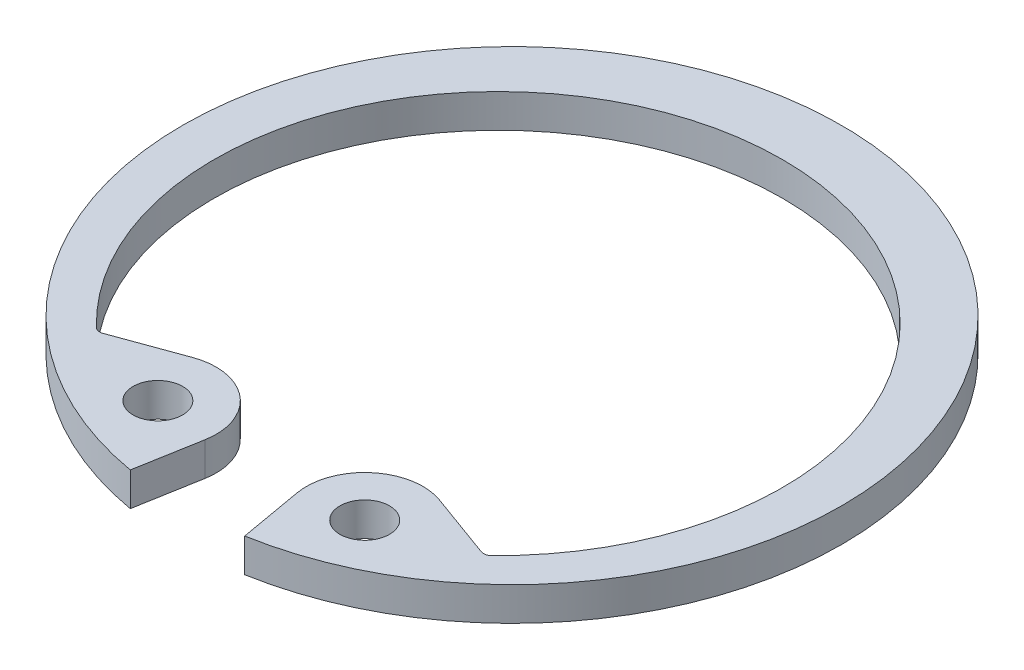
ISO-10303-21;
HEADER;
FILE_DESCRIPTION(('STEP AP214'),'2;1');
FILE_NAME('part.step','',(''),(''),'','','');
FILE_SCHEMA(('AUTOMOTIVE_DESIGN { 1 0 10303 214 1 1 1 1 }'));
ENDSEC;
DATA;
#1=APPLICATION_CONTEXT('core data for automotive mechanical design processes');
#2=APPLICATION_PROTOCOL_DEFINITION('international standard','automotive_design',2000,#1);
#3=PRODUCT_CONTEXT('',#1,'mechanical');
#4=PRODUCT('Part','Part','',(#3));
#5=PRODUCT_RELATED_PRODUCT_CATEGORY('part','',(#4));
#6=PRODUCT_DEFINITION_FORMATION('','',#4);
#7=PRODUCT_DEFINITION_CONTEXT('part definition',#1,'design');
#8=PRODUCT_DEFINITION('design','',#6,#7);
#9=PRODUCT_DEFINITION_SHAPE('','',#8);
#10=(LENGTH_UNIT() NAMED_UNIT(*) SI_UNIT(.MILLI.,.METRE.));
#11=(NAMED_UNIT(*) PLANE_ANGLE_UNIT() SI_UNIT($,.RADIAN.));
#12=(NAMED_UNIT(*) SI_UNIT($,.STERADIAN.) SOLID_ANGLE_UNIT());
#13=UNCERTAINTY_MEASURE_WITH_UNIT(LENGTH_MEASURE(1.E-05),#10,'distance_accuracy_value','');
#14=(GEOMETRIC_REPRESENTATION_CONTEXT(3) GLOBAL_UNCERTAINTY_ASSIGNED_CONTEXT((#13)) GLOBAL_UNIT_ASSIGNED_CONTEXT((#10,
#11,#12)) REPRESENTATION_CONTEXT('',''));
#15=CARTESIAN_POINT('',(0.,0.,0.));
#16=DIRECTION('',(0.,0.,1.));
#17=DIRECTION('',(1.,0.,0.));
#18=AXIS2_PLACEMENT_3D('',#15,#16,#17);
#19=CARTESIAN_POINT('',(3.28842498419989,-1.0668,7.97167259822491));
#20=DIRECTION('',(0.,1.,0.));
#21=DIRECTION('',(0.,0.,1.));
#22=AXIS2_PLACEMENT_3D('',#19,#20,#21);
#23=CYLINDRICAL_SURFACE('',#22,1.8542);
#24=CARTESIAN_POINT('',(3.28842498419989,0.,7.97167259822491));
#25=DIRECTION('',(0.,1.,0.));
#26=DIRECTION('',(0.,0.,-1.));
#27=AXIS2_PLACEMENT_3D('',#24,#25,#26);
#28=CIRCLE('',#27,1.8542);
#29=CARTESIAN_POINT('',(3.92259873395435,0.,6.22929454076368));
#30=VERTEX_POINT('',#29);
#31=CARTESIAN_POINT('',(1.46239444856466,0.,8.29365104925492));
#32=VERTEX_POINT('',#31);
#33=EDGE_CURVE('E137',#30,#32,#28,.T.);
#34=ORIENTED_EDGE('',*,*,#33,.F.);
#35=DIRECTION('',(0.,1.,0.));
#36=VECTOR('',#35,1.);
#37=CARTESIAN_POINT('',(3.92259873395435,-1.0668,6.22929454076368));
#38=LINE('',#37,#36);
#39=CARTESIAN_POINT('',(3.92259873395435,-1.0668,6.22929454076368));
#40=VERTEX_POINT('',#39);
#41=EDGE_CURVE('E114',#40,#30,#38,.T.);
#42=ORIENTED_EDGE('',*,*,#41,.F.);
#43=CARTESIAN_POINT('',(3.28842498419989,-1.0668,7.97167259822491));
#44=DIRECTION('',(0.,1.,0.));
#45=DIRECTION('',(0.,0.,-1.));
#46=AXIS2_PLACEMENT_3D('',#43,#44,#45);
#47=CIRCLE('',#46,1.8542);
#48=CARTESIAN_POINT('',(1.46239444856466,-1.0668,8.29365104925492));
#49=VERTEX_POINT('',#48);
#50=EDGE_CURVE('E107',#40,#49,#47,.T.);
#51=ORIENTED_EDGE('',*,*,#50,.T.);
#52=DIRECTION('',(0.,1.,0.));
#53=VECTOR('',#52,1.);
#54=CARTESIAN_POINT('',(1.46239444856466,-1.0668,8.29365104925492));
#55=LINE('',#54,#53);
#56=EDGE_CURVE('E90',#49,#32,#55,.T.);
#57=ORIENTED_EDGE('',*,*,#56,.T.);
#58=EDGE_LOOP('',(#34,#42,#51,#57));
#59=FACE_BOUND('',#58,.T.);
#60=ADVANCED_FACE('F15',(#59),#23,.T.);
#61=CARTESIAN_POINT('',(6.16282142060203,-1.0668,7.04466891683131));
#62=DIRECTION('',(0.342020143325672,0.,-0.939692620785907));
#63=DIRECTION('',(-0.939692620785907,0.,-0.342020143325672));
#64=AXIS2_PLACEMENT_3D('',#61,#62,#63);
#65=PLANE('',#64);
#66=DIRECTION('',(-0.939692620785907,0.,-0.342020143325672));
#67=VECTOR('',#66,1.);
#68=CARTESIAN_POINT('',(6.16282142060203,0.,7.04466891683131));
#69=LINE('',#68,#67);
#70=CARTESIAN_POINT('',(6.0150956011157,0.,6.9909011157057));
#71=VERTEX_POINT('',#70);
#72=EDGE_CURVE('E115',#71,#30,#69,.T.);
#73=ORIENTED_EDGE('',*,*,#72,.F.);
#74=DIRECTION('',(0.,-1.,0.));
#75=VECTOR('',#74,1.);
#76=CARTESIAN_POINT('',(6.0150956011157,-1.0668,6.9909011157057));
#77=LINE('',#76,#75);
#78=CARTESIAN_POINT('',(6.0150956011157,-1.0668,6.9909011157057));
#79=VERTEX_POINT('',#78);
#80=EDGE_CURVE('E30',#71,#79,#77,.T.);
#81=ORIENTED_EDGE('',*,*,#80,.T.);
#82=DIRECTION('',(-0.939692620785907,0.,-0.342020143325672));
#83=VECTOR('',#82,1.);
#84=CARTESIAN_POINT('',(6.16282142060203,-1.0668,7.04466891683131));
#85=LINE('',#84,#83);
#86=EDGE_CURVE('E101',#79,#40,#85,.T.);
#87=ORIENTED_EDGE('',*,*,#86,.T.);
#88=ORIENTED_EDGE('',*,*,#41,.T.);
#89=EDGE_LOOP('',(#73,#81,#87,#88));
#90=FACE_BOUND('',#89,.T.);
#91=ADVANCED_FACE('F192',(#90),#65,.T.);
#92=CARTESIAN_POINT('',(0.,-1.0668,0.437391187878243));
#93=DIRECTION('',(0.,1.,0.));
#94=DIRECTION('',(0.,0.,1.));
#95=AXIS2_PLACEMENT_3D('',#92,#93,#94);
#96=CYLINDRICAL_SURFACE('',#95,9.03529118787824);
#97=CARTESIAN_POINT('',(0.,0.,0.437391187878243));
#98=DIRECTION('',(0.,-1.,0.));
#99=DIRECTION('',(0.,0.,1.));
#100=AXIS2_PLACEMENT_3D('',#97,#98,#99);
#101=CIRCLE('',#100,9.03529118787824);
#102=CARTESIAN_POINT('',(-6.27846896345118,0.,6.93487641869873));
#103=VERTEX_POINT('',#102);
#104=CARTESIAN_POINT('',(6.27846896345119,0.,6.93487641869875));
#105=VERTEX_POINT('',#104);
#106=EDGE_CURVE('E117',#103,#105,#101,.T.);
#107=ORIENTED_EDGE('',*,*,#106,.F.);
#108=DIRECTION('',(0.,1.,0.));
#109=VECTOR('',#108,1.);
#110=CARTESIAN_POINT('',(-6.27846896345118,-1.0668,6.93487641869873));
#111=LINE('',#110,#109);
#112=CARTESIAN_POINT('',(-6.27846896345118,-1.0668,6.93487641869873));
#113=VERTEX_POINT('',#112);
#114=EDGE_CURVE('E168',#103,#113,#111,.F.);
#115=ORIENTED_EDGE('',*,*,#114,.T.);
#116=CARTESIAN_POINT('',(0.,-1.0668,0.437391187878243));
#117=DIRECTION('',(0.,-1.,0.));
#118=DIRECTION('',(0.,0.,1.));
#119=AXIS2_PLACEMENT_3D('',#116,#117,#118);
#120=CIRCLE('',#119,9.03529118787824);
#121=CARTESIAN_POINT('',(6.27846896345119,-1.0668,6.93487641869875));
#122=VERTEX_POINT('',#121);
#123=EDGE_CURVE('E133',#113,#122,#120,.T.);
#124=ORIENTED_EDGE('',*,*,#123,.T.);
#125=DIRECTION('',(0.,1.,0.));
#126=VECTOR('',#125,1.);
#127=CARTESIAN_POINT('',(6.27846896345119,-1.0668,6.93487641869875));
#128=LINE('',#127,#126);
#129=EDGE_CURVE('E165',#122,#105,#128,.T.);
#130=ORIENTED_EDGE('',*,*,#129,.T.);
#131=EDGE_LOOP('',(#107,#115,#124,#130));
#132=FACE_BOUND('',#131,.T.);
#133=ADVANCED_FACE('F188',(#132),#96,.F.);
#134=CARTESIAN_POINT('',(-6.16282142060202,-1.0668,7.04466891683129));
#135=DIRECTION('',(-0.342020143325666,0.,-0.939692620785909));
#136=DIRECTION('',(-0.93969262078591,0.,0.342020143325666));
#137=AXIS2_PLACEMENT_3D('',#134,#135,#136);
#138=PLANE('',#137);
#139=DIRECTION('',(-0.939692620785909,0.,0.342020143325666));
#140=VECTOR('',#139,1.);
#141=CARTESIAN_POINT('',(-6.16282142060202,-1.0668,7.04466891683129));
#142=LINE('',#141,#140);
#143=CARTESIAN_POINT('',(-3.92259873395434,-1.0668,6.22929454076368));
#144=VERTEX_POINT('',#143);
#145=CARTESIAN_POINT('',(-6.01509560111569,-1.0668,6.99090111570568));
#146=VERTEX_POINT('',#145);
#147=EDGE_CURVE('E130',#144,#146,#142,.T.);
#148=ORIENTED_EDGE('',*,*,#147,.T.);
#149=DIRECTION('',(0.,-1.,0.));
#150=VECTOR('',#149,1.);
#151=CARTESIAN_POINT('',(-6.01509560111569,0.,6.99090111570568));
#152=LINE('',#151,#150);
#153=CARTESIAN_POINT('',(-6.01509560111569,0.,6.99090111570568));
#154=VERTEX_POINT('',#153);
#155=EDGE_CURVE('E155',#146,#154,#152,.F.);
#156=ORIENTED_EDGE('',*,*,#155,.T.);
#157=DIRECTION('',(-0.939692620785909,0.,0.342020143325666));
#158=VECTOR('',#157,1.);
#159=CARTESIAN_POINT('',(-6.16282142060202,0.,7.04466891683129));
#160=LINE('',#159,#158);
#161=CARTESIAN_POINT('',(-3.92259873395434,0.,6.22929454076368));
#162=VERTEX_POINT('',#161);
#163=EDGE_CURVE('E150',#162,#154,#160,.T.);
#164=ORIENTED_EDGE('',*,*,#163,.F.);
#165=DIRECTION('',(0.,1.,0.));
#166=VECTOR('',#165,1.);
#167=CARTESIAN_POINT('',(-3.92259873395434,-1.0668,6.22929454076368));
#168=LINE('',#167,#166);
#169=EDGE_CURVE('E156',#144,#162,#168,.T.);
#170=ORIENTED_EDGE('',*,*,#169,.F.);
#171=EDGE_LOOP('',(#148,#156,#164,#170));
#172=FACE_BOUND('',#171,.T.);
#173=ADVANCED_FACE('F182',(#172),#138,.T.);
#174=CARTESIAN_POINT('',(-3.28842498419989,-1.0668,7.97167259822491));
#175=DIRECTION('',(0.,1.,0.));
#176=DIRECTION('',(0.,0.,1.));
#177=AXIS2_PLACEMENT_3D('',#174,#175,#176);
#178=CYLINDRICAL_SURFACE('',#177,1.8542);
#179=CARTESIAN_POINT('',(-3.28842498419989,0.,7.97167259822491));
#180=DIRECTION('',(0.,1.,0.));
#181=DIRECTION('',(0.,0.,1.));
#182=AXIS2_PLACEMENT_3D('',#179,#180,#181);
#183=CIRCLE('',#182,1.8542);
#184=CARTESIAN_POINT('',(-1.46239444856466,0.,8.29365104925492));
#185=VERTEX_POINT('',#184);
#186=EDGE_CURVE('E147',#185,#162,#183,.T.);
#187=ORIENTED_EDGE('',*,*,#186,.F.);
#188=DIRECTION('',(0.,1.,0.));
#189=VECTOR('',#188,1.);
#190=CARTESIAN_POINT('',(-1.46239444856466,-1.0668,8.29365104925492));
#191=LINE('',#190,#189);
#192=CARTESIAN_POINT('',(-1.46239444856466,-1.0668,8.29365104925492));
#193=VERTEX_POINT('',#192);
#194=EDGE_CURVE('E158',#193,#185,#191,.T.);
#195=ORIENTED_EDGE('',*,*,#194,.F.);
#196=CARTESIAN_POINT('',(-3.28842498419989,-1.0668,7.97167259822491));
#197=DIRECTION('',(0.,1.,0.));
#198=DIRECTION('',(0.,0.,1.));
#199=AXIS2_PLACEMENT_3D('',#196,#197,#198);
#200=CIRCLE('',#199,1.8542);
#201=EDGE_CURVE('E127',#193,#144,#200,.T.);
#202=ORIENTED_EDGE('',*,*,#201,.T.);
#203=ORIENTED_EDGE('',*,*,#169,.T.);
#204=EDGE_LOOP('',(#187,#195,#202,#203));
#205=FACE_BOUND('',#204,.T.);
#206=ADVANCED_FACE('F201',(#205),#178,.T.);
#207=CARTESIAN_POINT('',(-1.8193987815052,-1.0668,10.3183232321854));
#208=DIRECTION('',(0.984807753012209,0.,0.173648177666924));
#209=DIRECTION('',(0.173648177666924,0.,-0.984807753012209));
#210=AXIS2_PLACEMENT_3D('',#207,#208,#209);
#211=PLANE('',#210);
#212=DIRECTION('',(0.173648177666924,0.,-0.984807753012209));
#213=VECTOR('',#212,1.);
#214=CARTESIAN_POINT('',(-1.8193987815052,0.,10.3183232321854));
#215=LINE('',#214,#213);
#216=CARTESIAN_POINT('',(-1.8193987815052,0.,10.3183232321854));
#217=VERTEX_POINT('',#216);
#218=EDGE_CURVE('E144',#217,#185,#215,.T.);
#219=ORIENTED_EDGE('',*,*,#218,.F.);
#220=DIRECTION('',(0.,1.,0.));
#221=VECTOR('',#220,1.);
#222=CARTESIAN_POINT('',(-1.8193987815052,-1.0668,10.3183232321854));
#223=LINE('',#222,#221);
#224=CARTESIAN_POINT('',(-1.8193987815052,-1.0668,10.3183232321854));
#225=VERTEX_POINT('',#224);
#226=EDGE_CURVE('E160',#225,#217,#223,.T.);
#227=ORIENTED_EDGE('',*,*,#226,.F.);
#228=DIRECTION('',(0.173648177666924,0.,-0.984807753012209));
#229=VECTOR('',#228,1.);
#230=CARTESIAN_POINT('',(-1.8193987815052,-1.0668,10.3183232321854));
#231=LINE('',#230,#229);
#232=EDGE_CURVE('E124',#225,#193,#231,.T.);
#233=ORIENTED_EDGE('',*,*,#232,.T.);
#234=ORIENTED_EDGE('',*,*,#194,.T.);
#235=EDGE_LOOP('',(#219,#227,#233,#234));
#236=FACE_BOUND('',#235,.T.);
#237=ADVANCED_FACE('F198',(#236),#211,.T.);
#238=CARTESIAN_POINT('',(0.,-1.0668,0.));
#239=DIRECTION('',(0.,1.,0.));
#240=DIRECTION('',(0.,0.,1.));
#241=AXIS2_PLACEMENT_3D('',#238,#239,#240);
#242=CYLINDRICAL_SURFACE('',#241,10.4775);
#243=CARTESIAN_POINT('',(0.,0.,0.));
#244=DIRECTION('',(0.,1.,0.));
#245=DIRECTION('',(0.,0.,1.));
#246=AXIS2_PLACEMENT_3D('',#243,#244,#245);
#247=CIRCLE('',#246,10.4775);
#248=CARTESIAN_POINT('',(1.8193987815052,0.,10.3183232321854));
#249=VERTEX_POINT('',#248);
#250=EDGE_CURVE('E141',#249,#217,#247,.T.);
#251=ORIENTED_EDGE('',*,*,#250,.F.);
#252=DIRECTION('',(0.,1.,0.));
#253=VECTOR('',#252,1.);
#254=CARTESIAN_POINT('',(1.8193987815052,-1.0668,10.3183232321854));
#255=LINE('',#254,#253);
#256=CARTESIAN_POINT('',(1.8193987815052,-1.0668,10.3183232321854));
#257=VERTEX_POINT('',#256);
#258=EDGE_CURVE('E100',#257,#249,#255,.T.);
#259=ORIENTED_EDGE('',*,*,#258,.F.);
#260=CARTESIAN_POINT('',(0.,-1.0668,0.));
#261=DIRECTION('',(0.,1.,0.));
#262=DIRECTION('',(0.,0.,1.));
#263=AXIS2_PLACEMENT_3D('',#260,#261,#262);
#264=CIRCLE('',#263,10.4775);
#265=EDGE_CURVE('E110',#257,#225,#264,.T.);
#266=ORIENTED_EDGE('',*,*,#265,.T.);
#267=ORIENTED_EDGE('',*,*,#226,.T.);
#268=EDGE_LOOP('',(#251,#259,#266,#267));
#269=FACE_BOUND('',#268,.T.);
#270=ADVANCED_FACE('F196',(#269),#242,.T.);
#271=CARTESIAN_POINT('',(1.8193987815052,-1.0668,10.3183232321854));
#272=DIRECTION('',(-0.984807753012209,0.,0.173648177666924));
#273=DIRECTION('',(0.173648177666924,0.,0.984807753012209));
#274=AXIS2_PLACEMENT_3D('',#271,#272,#273);
#275=PLANE('',#274);
#276=DIRECTION('',(0.173648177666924,0.,0.984807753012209));
#277=VECTOR('',#276,1.);
#278=CARTESIAN_POINT('',(1.8193987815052,0.,10.3183232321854));
#279=LINE('',#278,#277);
#280=EDGE_CURVE('E95',#32,#249,#279,.T.);
#281=ORIENTED_EDGE('',*,*,#280,.F.);
#282=ORIENTED_EDGE('',*,*,#56,.F.);
#283=DIRECTION('',(0.173648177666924,0.,0.984807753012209));
#284=VECTOR('',#283,1.);
#285=CARTESIAN_POINT('',(1.8193987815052,-1.0668,10.3183232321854));
#286=LINE('',#285,#284);
#287=EDGE_CURVE('E93',#49,#257,#286,.T.);
#288=ORIENTED_EDGE('',*,*,#287,.T.);
#289=ORIENTED_EDGE('',*,*,#258,.T.);
#290=EDGE_LOOP('',(#281,#282,#288,#289));
#291=FACE_BOUND('',#290,.T.);
#292=ADVANCED_FACE('F92',(#291),#275,.T.);
#293=CARTESIAN_POINT('',(3.28842498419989,-1.0668,7.97167259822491));
#294=DIRECTION('',(0.,-1.,0.));
#295=DIRECTION('',(0.,0.,-1.));
#296=AXIS2_PLACEMENT_3D('',#293,#294,#295);
#297=PLANE('',#296);
#298=CARTESIAN_POINT('',(-3.28842498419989,-1.0668,7.97167259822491));
#299=DIRECTION('',(0.,1.,0.));
#300=DIRECTION('',(0.,0.,1.));
#301=AXIS2_PLACEMENT_3D('',#298,#299,#300);
#302=CIRCLE('',#301,0.7874);
#303=CARTESIAN_POINT('',(-3.28842498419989,-1.0668,8.75907259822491));
#304=VERTEX_POINT('',#303);
#305=EDGE_CURVE('E335',#304,#304,#302,.T.);
#306=ORIENTED_EDGE('',*,*,#305,.T.);
#307=EDGE_LOOP('',(#306));
#308=FACE_BOUND('',#307,.T.);
#309=CARTESIAN_POINT('',(3.28842498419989,-1.0668,7.97167259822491));
#310=DIRECTION('',(0.,1.,0.));
#311=DIRECTION('',(0.,0.,1.));
#312=AXIS2_PLACEMENT_3D('',#309,#310,#311);
#313=CIRCLE('',#312,0.7874);
#314=CARTESIAN_POINT('',(3.28842498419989,-1.0668,8.75907259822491));
#315=VERTEX_POINT('',#314);
#316=EDGE_CURVE('E139',#315,#315,#313,.T.);
#317=ORIENTED_EDGE('',*,*,#316,.T.);
#318=EDGE_LOOP('',(#317));
#319=FACE_BOUND('',#318,.T.);
#320=ORIENTED_EDGE('',*,*,#50,.F.);
#321=ORIENTED_EDGE('',*,*,#86,.F.);
#322=CARTESIAN_POINT('',(6.10196871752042,-1.0668,6.75221919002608));
#323=DIRECTION('',(0.,-1.,0.));
#324=DIRECTION('',(0.,0.,-1.));
#325=AXIS2_PLACEMENT_3D('',#322,#323,#324);
#326=CIRCLE('',#325,0.254);
#327=EDGE_CURVE('E10',#79,#122,#326,.F.);
#328=ORIENTED_EDGE('',*,*,#327,.T.);
#329=ORIENTED_EDGE('',*,*,#123,.F.);
#330=CARTESIAN_POINT('',(-6.10196871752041,-1.0668,6.75221919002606));
#331=DIRECTION('',(0.,-1.,0.));
#332=DIRECTION('',(0.,0.,-1.));
#333=AXIS2_PLACEMENT_3D('',#330,#331,#332);
#334=CIRCLE('',#333,0.254);
#335=EDGE_CURVE('E173',#113,#146,#334,.F.);
#336=ORIENTED_EDGE('',*,*,#335,.T.);
#337=ORIENTED_EDGE('',*,*,#147,.F.);
#338=ORIENTED_EDGE('',*,*,#201,.F.);
#339=ORIENTED_EDGE('',*,*,#232,.F.);
#340=ORIENTED_EDGE('',*,*,#265,.F.);
#341=ORIENTED_EDGE('',*,*,#287,.F.);
#342=EDGE_LOOP('',(#320,#321,#328,#329,#336,#337,#338,#339,#340,#341));
#343=FACE_BOUND('',#342,.T.);
#344=ADVANCED_FACE('F106',(#308,#319,#343),#297,.T.);
#345=CARTESIAN_POINT('',(3.28842498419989,0.,7.97167259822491));
#346=DIRECTION('',(0.,-1.,0.));
#347=DIRECTION('',(0.,0.,-1.));
#348=AXIS2_PLACEMENT_3D('',#345,#346,#347);
#349=PLANE('',#348);
#350=CARTESIAN_POINT('',(-3.28842498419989,0.,7.97167259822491));
#351=DIRECTION('',(0.,1.,0.));
#352=DIRECTION('',(0.,0.,1.));
#353=AXIS2_PLACEMENT_3D('',#350,#351,#352);
#354=CIRCLE('',#353,0.7874);
#355=CARTESIAN_POINT('',(-3.28842498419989,0.,8.75907259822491));
#356=VERTEX_POINT('',#355);
#357=EDGE_CURVE('E331',#356,#356,#354,.T.);
#358=ORIENTED_EDGE('',*,*,#357,.F.);
#359=EDGE_LOOP('',(#358));
#360=FACE_BOUND('',#359,.T.);
#361=CARTESIAN_POINT('',(3.28842498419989,0.,7.97167259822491));
#362=DIRECTION('',(0.,1.,0.));
#363=DIRECTION('',(0.,0.,1.));
#364=AXIS2_PLACEMENT_3D('',#361,#362,#363);
#365=CIRCLE('',#364,0.7874);
#366=CARTESIAN_POINT('',(3.28842498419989,0.,8.75907259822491));
#367=VERTEX_POINT('',#366);
#368=EDGE_CURVE('E120',#367,#367,#365,.T.);
#369=ORIENTED_EDGE('',*,*,#368,.F.);
#370=EDGE_LOOP('',(#369));
#371=FACE_BOUND('',#370,.T.);
#372=ORIENTED_EDGE('',*,*,#33,.T.);
#373=ORIENTED_EDGE('',*,*,#280,.T.);
#374=ORIENTED_EDGE('',*,*,#250,.T.);
#375=ORIENTED_EDGE('',*,*,#218,.T.);
#376=ORIENTED_EDGE('',*,*,#186,.T.);
#377=ORIENTED_EDGE('',*,*,#163,.T.);
#378=CARTESIAN_POINT('',(-6.10196871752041,0.,6.75221919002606));
#379=DIRECTION('',(0.,-1.,0.));
#380=DIRECTION('',(0.,0.,-1.));
#381=AXIS2_PLACEMENT_3D('',#378,#379,#380);
#382=CIRCLE('',#381,0.254);
#383=EDGE_CURVE('E171',#154,#103,#382,.T.);
#384=ORIENTED_EDGE('',*,*,#383,.T.);
#385=ORIENTED_EDGE('',*,*,#106,.T.);
#386=CARTESIAN_POINT('',(6.10196871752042,0.,6.75221919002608));
#387=DIRECTION('',(0.,-1.,0.));
#388=DIRECTION('',(0.,0.,-1.));
#389=AXIS2_PLACEMENT_3D('',#386,#387,#388);
#390=CIRCLE('',#389,0.254);
#391=EDGE_CURVE('E23',#105,#71,#390,.T.);
#392=ORIENTED_EDGE('',*,*,#391,.T.);
#393=ORIENTED_EDGE('',*,*,#72,.T.);
#394=EDGE_LOOP('',(#372,#373,#374,#375,#376,#377,#384,#385,#392,#393));
#395=FACE_BOUND('',#394,.T.);
#396=ADVANCED_FACE('F186',(#360,#371,#395),#349,.F.);
#397=CARTESIAN_POINT('',(3.28842498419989,-1.0668,7.97167259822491));
#398=DIRECTION('',(0.,1.,0.));
#399=DIRECTION('',(0.,0.,1.));
#400=AXIS2_PLACEMENT_3D('',#397,#398,#399);
#401=CYLINDRICAL_SURFACE('',#400,0.7874);
#402=ORIENTED_EDGE('',*,*,#316,.F.);
#403=EDGE_LOOP('',(#402));
#404=FACE_BOUND('',#403,.T.);
#405=ORIENTED_EDGE('',*,*,#368,.T.);
#406=EDGE_LOOP('',(#405));
#407=FACE_BOUND('',#406,.T.);
#408=ADVANCED_FACE('F228',(#404,#407),#401,.F.);
#409=CARTESIAN_POINT('',(-3.28842498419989,-1.0668,7.97167259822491));
#410=DIRECTION('',(0.,1.,0.));
#411=DIRECTION('',(0.,0.,1.));
#412=AXIS2_PLACEMENT_3D('',#409,#410,#411);
#413=CYLINDRICAL_SURFACE('',#412,0.7874);
#414=ORIENTED_EDGE('',*,*,#305,.F.);
#415=EDGE_LOOP('',(#414));
#416=FACE_BOUND('',#415,.T.);
#417=ORIENTED_EDGE('',*,*,#357,.T.);
#418=EDGE_LOOP('',(#417));
#419=FACE_BOUND('',#418,.T.);
#420=ADVANCED_FACE('F222',(#416,#419),#413,.F.);
#421=CARTESIAN_POINT('',(-6.10196871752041,-1.0668,6.75221919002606));
#422=DIRECTION('',(0.,1.,0.));
#423=DIRECTION('',(0.,0.,1.));
#424=AXIS2_PLACEMENT_3D('',#421,#422,#423);
#425=CYLINDRICAL_SURFACE('',#424,0.254);
#426=ORIENTED_EDGE('',*,*,#335,.F.);
#427=ORIENTED_EDGE('',*,*,#114,.F.);
#428=ORIENTED_EDGE('',*,*,#383,.F.);
#429=ORIENTED_EDGE('',*,*,#155,.F.);
#430=EDGE_LOOP('',(#426,#427,#428,#429));
#431=FACE_BOUND('',#430,.T.);
#432=ADVANCED_FACE('F184',(#431),#425,.F.);
#433=CARTESIAN_POINT('',(6.10196871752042,-1.0668,6.75221919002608));
#434=DIRECTION('',(0.,1.,0.));
#435=DIRECTION('',(0.,0.,1.));
#436=AXIS2_PLACEMENT_3D('',#433,#434,#435);
#437=CYLINDRICAL_SURFACE('',#436,0.254);
#438=ORIENTED_EDGE('',*,*,#327,.F.);
#439=ORIENTED_EDGE('',*,*,#80,.F.);
#440=ORIENTED_EDGE('',*,*,#391,.F.);
#441=ORIENTED_EDGE('',*,*,#129,.F.);
#442=EDGE_LOOP('',(#438,#439,#440,#441));
#443=FACE_BOUND('',#442,.T.);
#444=ADVANCED_FACE('F17',(#443),#437,.F.);
#445=CLOSED_SHELL('',(#60,#91,#133,#173,#206,#237,#270,#292,#344,#396,#408,#420,#432,#444));
#446=MANIFOLD_SOLID_BREP('B1',#445);
#447=ADVANCED_BREP_SHAPE_REPRESENTATION('',(#18,#446),#14);
#448=SHAPE_DEFINITION_REPRESENTATION(#9,#447);
ENDSEC;
END-ISO-10303-21;
